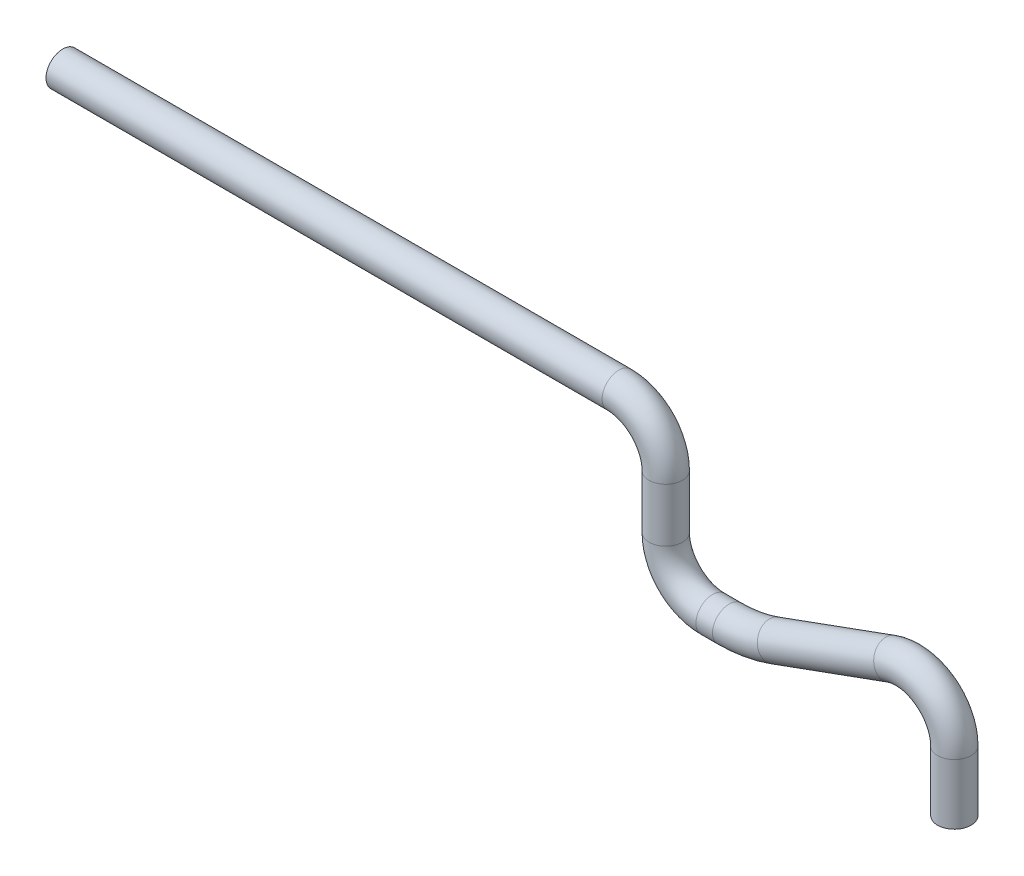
ISO-10303-21;
HEADER;
FILE_DESCRIPTION(('STEP AP214'),'2;1');
FILE_NAME('part.step','',(''),(''),'','','');
FILE_SCHEMA(('AUTOMOTIVE_DESIGN { 1 0 10303 214 1 1 1 1 }'));
ENDSEC;
DATA;
#1=APPLICATION_CONTEXT('core data for automotive mechanical design processes');
#2=APPLICATION_PROTOCOL_DEFINITION('international standard','automotive_design',2000,#1);
#3=PRODUCT_CONTEXT('',#1,'mechanical');
#4=PRODUCT('Part','Part','',(#3));
#5=PRODUCT_RELATED_PRODUCT_CATEGORY('part','',(#4));
#6=PRODUCT_DEFINITION_FORMATION('','',#4);
#7=PRODUCT_DEFINITION_CONTEXT('part definition',#1,'design');
#8=PRODUCT_DEFINITION('design','',#6,#7);
#9=PRODUCT_DEFINITION_SHAPE('','',#8);
#10=(LENGTH_UNIT() NAMED_UNIT(*) SI_UNIT(.MILLI.,.METRE.));
#11=(NAMED_UNIT(*) PLANE_ANGLE_UNIT() SI_UNIT($,.RADIAN.));
#12=(NAMED_UNIT(*) SI_UNIT($,.STERADIAN.) SOLID_ANGLE_UNIT());
#13=UNCERTAINTY_MEASURE_WITH_UNIT(LENGTH_MEASURE(1.E-05),#10,'distance_accuracy_value','');
#14=(GEOMETRIC_REPRESENTATION_CONTEXT(3) GLOBAL_UNCERTAINTY_ASSIGNED_CONTEXT((#13)) GLOBAL_UNIT_ASSIGNED_CONTEXT((#10,
#11,#12)) REPRESENTATION_CONTEXT('',''));
#15=CARTESIAN_POINT('',(0.,0.,0.));
#16=DIRECTION('',(0.,0.,1.));
#17=DIRECTION('',(1.,0.,0.));
#18=AXIS2_PLACEMENT_3D('',#15,#16,#17);
#19=CARTESIAN_POINT('',(43.0701638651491,-21.0523914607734,0.));
#20=DIRECTION('',(0.,-1.,0.));
#21=DIRECTION('',(1.,0.,0.));
#22=AXIS2_PLACEMENT_3D('',#19,#20,#21);
#23=CYLINDRICAL_SURFACE('',#22,2.5);
#24=CARTESIAN_POINT('',(43.0701638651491,-21.0523914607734,0.));
#25=DIRECTION('',(0.,-1.,0.));
#26=DIRECTION('',(0.,0.,-1.));
#27=AXIS2_PLACEMENT_3D('',#24,#25,#26);
#28=CIRCLE('',#27,2.5);
#29=CARTESIAN_POINT('',(45.5701638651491,-21.0523914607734,0.));
#30=VERTEX_POINT('',#29);
#31=EDGE_CURVE('E30',#30,#30,#28,.T.);
#32=ORIENTED_EDGE('',*,*,#31,.T.);
#33=EDGE_LOOP('',(#32));
#34=FACE_BOUND('',#33,.T.);
#35=CARTESIAN_POINT('',(43.0701638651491,-30.0553554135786,0.));
#36=DIRECTION('',(0.,-1.,0.));
#37=DIRECTION('',(0.,0.,-1.));
#38=AXIS2_PLACEMENT_3D('',#35,#36,#37);
#39=CIRCLE('',#38,2.5);
#40=CARTESIAN_POINT('',(43.0701638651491,-30.0553554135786,-2.50000000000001));
#41=VERTEX_POINT('',#40);
#42=EDGE_CURVE('E10',#41,#41,#39,.T.);
#43=ORIENTED_EDGE('',*,*,#42,.F.);
#44=EDGE_LOOP('',(#43));
#45=FACE_BOUND('',#44,.T.);
#46=ADVANCED_FACE('F24',(#34,#45),#23,.T.);
#47=CARTESIAN_POINT('',(36.0701638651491,-21.0523914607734,0.));
#48=DIRECTION('',(0.,0.,-1.));
#49=DIRECTION('',(-1.,0.,0.));
#50=AXIS2_PLACEMENT_3D('',#47,#48,#49);
#51=TOROIDAL_SURFACE('',#50,7.,2.5);
#52=CARTESIAN_POINT('',(33.6760228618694,-14.474543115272,0.));
#53=DIRECTION('',(0.939692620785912,0.342020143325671,0.));
#54=DIRECTION('',(0.,0.,-1.));
#55=AXIS2_PLACEMENT_3D('',#52,#53,#54);
#56=CIRCLE('',#55,2.5);
#57=CARTESIAN_POINT('',(32.8209725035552,-12.1253115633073,0.));
#58=VERTEX_POINT('',#57);
#59=EDGE_CURVE('E34',#58,#58,#56,.T.);
#60=CARTESIAN_POINT('',(36.0701638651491,-21.0523914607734,0.));
#61=DIRECTION('',(0.,0.,-1.));
#62=DIRECTION('',(-1.,0.,0.));
#63=AXIS2_PLACEMENT_3D('',#60,#61,#62);
#64=CIRCLE('',#63,9.5);
#65=EDGE_CURVE('',#58,#30,#64,.T.);
#66=ORIENTED_EDGE('',*,*,#59,.T.);
#67=ORIENTED_EDGE('',*,*,#31,.F.);
#68=ORIENTED_EDGE('',*,*,#65,.T.);
#69=ORIENTED_EDGE('',*,*,#65,.F.);
#70=EDGE_LOOP('',(#66,#68,#67,#69));
#71=FACE_BOUND('',#70,.T.);
#72=ADVANCED_FACE('F82',(#71),#51,.T.);
#73=CARTESIAN_POINT('',(16.3138632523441,-20.7938524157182,0.));
#74=DIRECTION('',(0.939692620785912,0.342020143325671,0.));
#75=DIRECTION('',(-0.342020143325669,0.939692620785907,0.));
#76=AXIS2_PLACEMENT_3D('',#73,#74,#75);
#77=CYLINDRICAL_SURFACE('',#76,2.5);
#78=CARTESIAN_POINT('',(16.3138632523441,-20.7938524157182,0.));
#79=DIRECTION('',(0.939692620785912,0.342020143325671,0.));
#80=DIRECTION('',(0.,0.,-1.));
#81=AXIS2_PLACEMENT_3D('',#78,#79,#80);
#82=CIRCLE('',#81,2.5);
#83=CARTESIAN_POINT('',(17.1689136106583,-23.1430839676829,0.));
#84=VERTEX_POINT('',#83);
#85=EDGE_CURVE('E38',#84,#84,#82,.T.);
#86=ORIENTED_EDGE('',*,*,#85,.T.);
#87=EDGE_LOOP('',(#86));
#88=FACE_BOUND('',#87,.T.);
#89=ORIENTED_EDGE('',*,*,#59,.F.);
#90=EDGE_LOOP('',(#89));
#91=FACE_BOUND('',#90,.T.);
#92=ADVANCED_FACE('F86',(#88,#91),#77,.T.);
#93=CARTESIAN_POINT('',(9.47346038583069,-2.,0.));
#94=DIRECTION('',(0.,0.,1.));
#95=DIRECTION('',(1.,0.,0.));
#96=AXIS2_PLACEMENT_3D('',#93,#94,#95);
#97=TOROIDAL_SURFACE('',#96,20.,2.5);
#98=CARTESIAN_POINT('',(9.47346038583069,-22.,0.));
#99=DIRECTION('',(1.,0.,0.));
#100=DIRECTION('',(0.,0.,-1.));
#101=AXIS2_PLACEMENT_3D('',#98,#99,#100);
#102=CIRCLE('',#101,2.5);
#103=CARTESIAN_POINT('',(9.47346038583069,-24.5,0.));
#104=VERTEX_POINT('',#103);
#105=EDGE_CURVE('E43',#104,#104,#102,.T.);
#106=CARTESIAN_POINT('',(9.47346038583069,-2.,0.));
#107=DIRECTION('',(0.,0.,1.));
#108=DIRECTION('',(1.,0.,0.));
#109=AXIS2_PLACEMENT_3D('',#106,#107,#108);
#110=CIRCLE('',#109,22.5);
#111=EDGE_CURVE('',#104,#84,#110,.T.);
#112=ORIENTED_EDGE('',*,*,#105,.T.);
#113=ORIENTED_EDGE('',*,*,#85,.F.);
#114=ORIENTED_EDGE('',*,*,#111,.T.);
#115=ORIENTED_EDGE('',*,*,#111,.F.);
#116=EDGE_LOOP('',(#112,#114,#113,#115));
#117=FACE_BOUND('',#116,.T.);
#118=ADVANCED_FACE('F92',(#117),#97,.T.);
#119=CARTESIAN_POINT('',(7.00000000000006,-22.,0.));
#120=DIRECTION('',(1.,0.,0.));
#121=DIRECTION('',(0.,1.,0.));
#122=AXIS2_PLACEMENT_3D('',#119,#120,#121);
#123=CYLINDRICAL_SURFACE('',#122,2.5);
#124=CARTESIAN_POINT('',(7.00000000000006,-22.,0.));
#125=DIRECTION('',(1.,0.,0.));
#126=DIRECTION('',(0.,0.,-1.));
#127=AXIS2_PLACEMENT_3D('',#124,#125,#126);
#128=CIRCLE('',#127,2.5);
#129=CARTESIAN_POINT('',(7.00000000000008,-24.5,0.));
#130=VERTEX_POINT('',#129);
#131=EDGE_CURVE('E46',#130,#130,#128,.T.);
#132=ORIENTED_EDGE('',*,*,#131,.T.);
#133=EDGE_LOOP('',(#132));
#134=FACE_BOUND('',#133,.T.);
#135=ORIENTED_EDGE('',*,*,#105,.F.);
#136=EDGE_LOOP('',(#135));
#137=FACE_BOUND('',#136,.T.);
#138=ADVANCED_FACE('F99',(#134,#137),#123,.T.);
#139=CARTESIAN_POINT('',(7.00000000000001,-15.,0.));
#140=DIRECTION('',(0.,0.,1.));
#141=DIRECTION('',(1.,0.,0.));
#142=AXIS2_PLACEMENT_3D('',#139,#140,#141);
#143=TOROIDAL_SURFACE('',#142,7.,2.5);
#144=CARTESIAN_POINT('',(0.,-15.,0.));
#145=DIRECTION('',(0.,-1.,0.));
#146=DIRECTION('',(0.,0.,-1.));
#147=AXIS2_PLACEMENT_3D('',#144,#145,#146);
#148=CIRCLE('',#147,2.5);
#149=CARTESIAN_POINT('',(-2.49999999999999,-14.9999999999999,0.));
#150=VERTEX_POINT('',#149);
#151=EDGE_CURVE('E49',#150,#150,#148,.T.);
#152=CARTESIAN_POINT('',(7.00000000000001,-15.,0.));
#153=DIRECTION('',(0.,0.,1.));
#154=DIRECTION('',(1.,0.,0.));
#155=AXIS2_PLACEMENT_3D('',#152,#153,#154);
#156=CIRCLE('',#155,9.5);
#157=EDGE_CURVE('',#150,#130,#156,.T.);
#158=ORIENTED_EDGE('',*,*,#151,.T.);
#159=ORIENTED_EDGE('',*,*,#131,.F.);
#160=ORIENTED_EDGE('',*,*,#157,.T.);
#161=ORIENTED_EDGE('',*,*,#157,.F.);
#162=EDGE_LOOP('',(#158,#160,#159,#161));
#163=FACE_BOUND('',#162,.T.);
#164=ADVANCED_FACE('F103',(#163),#143,.T.);
#165=CARTESIAN_POINT('',(0.,-7.00000000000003,0.));
#166=DIRECTION('',(0.,-1.,0.));
#167=DIRECTION('',(1.,0.,0.));
#168=AXIS2_PLACEMENT_3D('',#165,#166,#167);
#169=CYLINDRICAL_SURFACE('',#168,2.5);
#170=CARTESIAN_POINT('',(0.,-7.00000000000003,0.));
#171=DIRECTION('',(0.,-1.,0.));
#172=DIRECTION('',(0.,0.,-1.));
#173=AXIS2_PLACEMENT_3D('',#170,#171,#172);
#174=CIRCLE('',#173,2.5);
#175=CARTESIAN_POINT('',(2.49999999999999,-7.00000000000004,0.));
#176=VERTEX_POINT('',#175);
#177=EDGE_CURVE('E52',#176,#176,#174,.T.);
#178=ORIENTED_EDGE('',*,*,#177,.T.);
#179=EDGE_LOOP('',(#178));
#180=FACE_BOUND('',#179,.T.);
#181=ORIENTED_EDGE('',*,*,#151,.F.);
#182=EDGE_LOOP('',(#181));
#183=FACE_BOUND('',#182,.T.);
#184=ADVANCED_FACE('F77',(#180,#183),#169,.T.);
#185=CARTESIAN_POINT('',(-7.00000000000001,-7.00000000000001,0.));
#186=DIRECTION('',(0.,0.,-1.));
#187=DIRECTION('',(-1.,0.,0.));
#188=AXIS2_PLACEMENT_3D('',#185,#186,#187);
#189=TOROIDAL_SURFACE('',#188,7.,2.5);
#190=CARTESIAN_POINT('',(-7.00000000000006,0.,0.));
#191=DIRECTION('',(1.,0.,0.));
#192=DIRECTION('',(0.,0.,-1.));
#193=AXIS2_PLACEMENT_3D('',#190,#191,#192);
#194=CIRCLE('',#193,2.5);
#195=CARTESIAN_POINT('',(-7.00000000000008,2.49999999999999,0.));
#196=VERTEX_POINT('',#195);
#197=EDGE_CURVE('E55',#196,#196,#194,.T.);
#198=CARTESIAN_POINT('',(-7.00000000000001,-7.00000000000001,0.));
#199=DIRECTION('',(0.,0.,-1.));
#200=DIRECTION('',(-1.,0.,0.));
#201=AXIS2_PLACEMENT_3D('',#198,#199,#200);
#202=CIRCLE('',#201,9.5);
#203=EDGE_CURVE('',#196,#176,#202,.T.);
#204=ORIENTED_EDGE('',*,*,#197,.T.);
#205=ORIENTED_EDGE('',*,*,#177,.F.);
#206=ORIENTED_EDGE('',*,*,#203,.T.);
#207=ORIENTED_EDGE('',*,*,#203,.F.);
#208=EDGE_LOOP('',(#204,#206,#205,#207));
#209=FACE_BOUND('',#208,.T.);
#210=ADVANCED_FACE('F67',(#209),#189,.T.);
#211=CARTESIAN_POINT('',(-7.00000000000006,0.,0.));
#212=DIRECTION('',(-1.,0.,0.));
#213=DIRECTION('',(0.,0.,1.));
#214=AXIS2_PLACEMENT_3D('',#211,#212,#213);
#215=CYLINDRICAL_SURFACE('',#214,2.5);
#216=ORIENTED_EDGE('',*,*,#197,.F.);
#217=EDGE_LOOP('',(#216));
#218=FACE_BOUND('',#217,.T.);
#219=CARTESIAN_POINT('',(-90.0000000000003,-1.94289029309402E-13,8.2572837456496E-13));
#220=DIRECTION('',(-1.,0.,0.));
#221=DIRECTION('',(0.,0.,1.));
#222=AXIS2_PLACEMENT_3D('',#219,#220,#221);
#223=CIRCLE('',#222,2.5);
#224=CARTESIAN_POINT('',(-90.0000000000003,-1.94367885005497E-13,2.50000000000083));
#225=VERTEX_POINT('',#224);
#226=EDGE_CURVE('E58',#225,#225,#223,.T.);
#227=ORIENTED_EDGE('',*,*,#226,.F.);
#228=EDGE_LOOP('',(#227));
#229=FACE_BOUND('',#228,.T.);
#230=ADVANCED_FACE('F64',(#218,#229),#215,.T.);
#231=CARTESIAN_POINT('',(43.0701638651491,-30.0553554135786,0.));
#232=DIRECTION('',(0.,-1.,0.));
#233=DIRECTION('',(0.,0.,-1.));
#234=AXIS2_PLACEMENT_3D('',#231,#232,#233);
#235=PLANE('',#234);
#236=ORIENTED_EDGE('',*,*,#42,.T.);
#237=EDGE_LOOP('',(#236));
#238=FACE_BOUND('',#237,.T.);
#239=ADVANCED_FACE('F66',(#238),#235,.T.);
#240=CARTESIAN_POINT('',(-90.0000000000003,-1.94289029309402E-13,8.2572837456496E-13));
#241=DIRECTION('',(-1.,0.,0.));
#242=DIRECTION('',(0.,0.,1.));
#243=AXIS2_PLACEMENT_3D('',#240,#241,#242);
#244=PLANE('',#243);
#245=ORIENTED_EDGE('',*,*,#226,.T.);
#246=EDGE_LOOP('',(#245));
#247=FACE_BOUND('',#246,.T.);
#248=ADVANCED_FACE('F62',(#247),#244,.T.);
#249=CLOSED_SHELL('',(#46,#72,#92,#118,#138,#164,#184,#210,#230,#239,#248));
#250=MANIFOLD_SOLID_BREP('B2',#249);
#251=ADVANCED_BREP_SHAPE_REPRESENTATION('',(#18,#250),#14);
#252=SHAPE_DEFINITION_REPRESENTATION(#9,#251);
ENDSEC;
END-ISO-10303-21;
